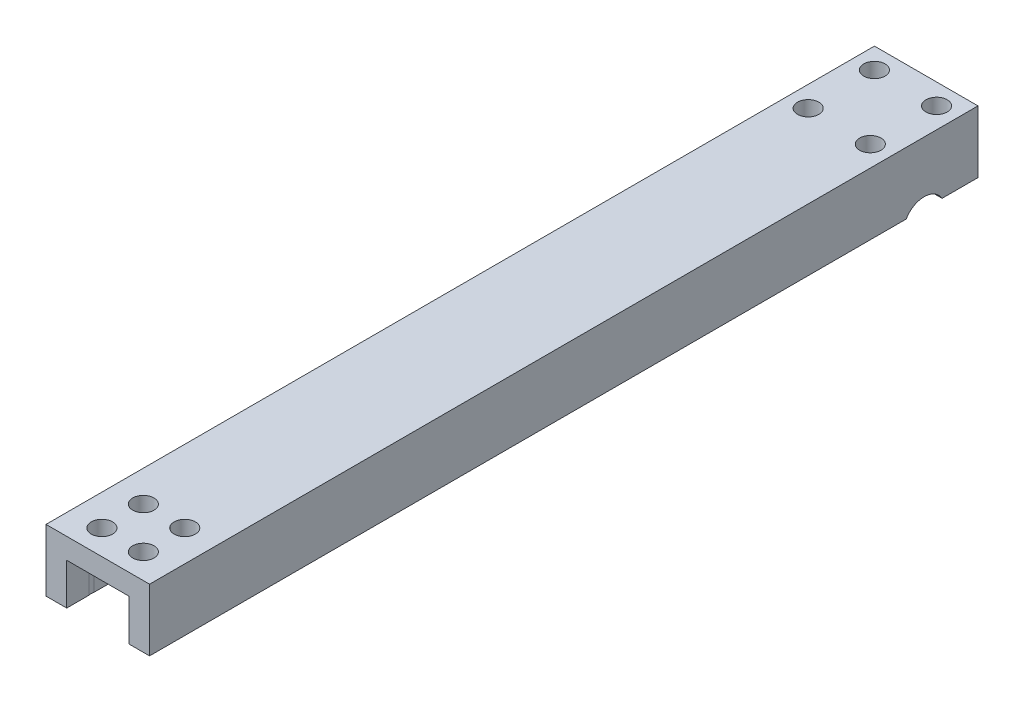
ISO-10303-21;
HEADER;
FILE_DESCRIPTION(('STEP AP214'),'2;1');
FILE_NAME('part.step','',(''),(''),'','','');
FILE_SCHEMA(('AUTOMOTIVE_DESIGN { 1 0 10303 214 1 1 1 1 }'));
ENDSEC;
DATA;
#1=APPLICATION_CONTEXT('core data for automotive mechanical design processes');
#2=APPLICATION_PROTOCOL_DEFINITION('international standard','automotive_design',2000,#1);
#3=PRODUCT_CONTEXT('',#1,'mechanical');
#4=PRODUCT('Part','Part','',(#3));
#5=PRODUCT_RELATED_PRODUCT_CATEGORY('part','',(#4));
#6=PRODUCT_DEFINITION_FORMATION('','',#4);
#7=PRODUCT_DEFINITION_CONTEXT('part definition',#1,'design');
#8=PRODUCT_DEFINITION('design','',#6,#7);
#9=PRODUCT_DEFINITION_SHAPE('','',#8);
#10=(LENGTH_UNIT() NAMED_UNIT(*) SI_UNIT(.MILLI.,.METRE.));
#11=(NAMED_UNIT(*) PLANE_ANGLE_UNIT() SI_UNIT($,.RADIAN.));
#12=(NAMED_UNIT(*) SI_UNIT($,.STERADIAN.) SOLID_ANGLE_UNIT());
#13=UNCERTAINTY_MEASURE_WITH_UNIT(LENGTH_MEASURE(1.E-05),#10,'distance_accuracy_value','');
#14=(GEOMETRIC_REPRESENTATION_CONTEXT(3) GLOBAL_UNCERTAINTY_ASSIGNED_CONTEXT((#13)) GLOBAL_UNIT_ASSIGNED_CONTEXT((#10,
#11,#12)) REPRESENTATION_CONTEXT('',''));
#15=CARTESIAN_POINT('',(0.,0.,0.));
#16=DIRECTION('',(0.,0.,1.));
#17=DIRECTION('',(1.,0.,0.));
#18=AXIS2_PLACEMENT_3D('',#15,#16,#17);
#19=CARTESIAN_POINT('',(-7.9375,0.,63.5));
#20=DIRECTION('',(0.,1.,0.));
#21=DIRECTION('',(0.,0.,1.));
#22=AXIS2_PLACEMENT_3D('',#19,#20,#21);
#23=PLANE('',#22);
#24=CARTESIAN_POINT('',(-4.7625,0.,-50.165));
#25=DIRECTION('',(0.,1.,0.));
#26=DIRECTION('',(0.,0.,1.));
#27=AXIS2_PLACEMENT_3D('',#24,#25,#26);
#28=CIRCLE('',#27,1.63195);
#29=CARTESIAN_POINT('',(-4.7625,0.,-48.53305));
#30=VERTEX_POINT('',#29);
#31=EDGE_CURVE('E286',#30,#30,#28,.T.);
#32=ORIENTED_EDGE('',*,*,#31,.T.);
#33=EDGE_LOOP('',(#32));
#34=FACE_BOUND('',#33,.T.);
#35=CARTESIAN_POINT('',(4.7625,0.,-50.165));
#36=DIRECTION('',(0.,1.,0.));
#37=DIRECTION('',(0.,0.,1.));
#38=AXIS2_PLACEMENT_3D('',#35,#36,#37);
#39=CIRCLE('',#38,1.63195);
#40=CARTESIAN_POINT('',(4.7625,0.,-48.53305));
#41=VERTEX_POINT('',#40);
#42=EDGE_CURVE('E266',#41,#41,#39,.T.);
#43=ORIENTED_EDGE('',*,*,#42,.T.);
#44=EDGE_LOOP('',(#43));
#45=FACE_BOUND('',#44,.T.);
#46=DIRECTION('',(0.,0.,-1.));
#47=VECTOR('',#46,1.);
#48=CARTESIAN_POINT('',(-7.9375,0.,63.5));
#49=LINE('',#48,#47);
#50=CARTESIAN_POINT('',(-7.9375,0.,63.5));
#51=VERTEX_POINT('',#50);
#52=CARTESIAN_POINT('',(-7.9375,0.,-52.4953693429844));
#53=VERTEX_POINT('',#52);
#54=EDGE_CURVE('E174',#51,#53,#49,.T.);
#55=ORIENTED_EDGE('',*,*,#54,.T.);
#56=DIRECTION('',(1.,0.,0.));
#57=VECTOR('',#56,1.);
#58=CARTESIAN_POINT('',(-7.9375,0.,-52.4953693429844));
#59=LINE('',#58,#57);
#60=CARTESIAN_POINT('',(7.9375,0.,-52.4953693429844));
#61=VERTEX_POINT('',#60);
#62=EDGE_CURVE('E155',#53,#61,#59,.T.);
#63=ORIENTED_EDGE('',*,*,#62,.T.);
#64=DIRECTION('',(0.,0.,-1.));
#65=VECTOR('',#64,1.);
#66=CARTESIAN_POINT('',(7.9375,0.,63.5));
#67=LINE('',#66,#65);
#68=CARTESIAN_POINT('',(7.9375,0.,63.5));
#69=VERTEX_POINT('',#68);
#70=EDGE_CURVE('E175',#69,#61,#67,.T.);
#71=ORIENTED_EDGE('',*,*,#70,.F.);
#72=DIRECTION('',(1.,0.,0.));
#73=VECTOR('',#72,1.);
#74=CARTESIAN_POINT('',(-7.9375,0.,63.5));
#75=LINE('',#74,#73);
#76=CARTESIAN_POINT('',(4.7625,0.,63.5));
#77=VERTEX_POINT('',#76);
#78=EDGE_CURVE('E234',#77,#69,#75,.T.);
#79=ORIENTED_EDGE('',*,*,#78,.F.);
#80=DIRECTION('',(0.,0.,-1.));
#81=VECTOR('',#80,1.);
#82=CARTESIAN_POINT('',(4.7625,0.,63.5));
#83=LINE('',#82,#81);
#84=CARTESIAN_POINT('',(4.7625,0.,60.0682916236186));
#85=VERTEX_POINT('',#84);
#86=EDGE_CURVE('E336',#77,#85,#83,.T.);
#87=ORIENTED_EDGE('',*,*,#86,.T.);
#88=CARTESIAN_POINT('',(3.175,0.,59.69));
#89=DIRECTION('',(0.,1.,0.));
#90=DIRECTION('',(0.,0.,1.));
#91=AXIS2_PLACEMENT_3D('',#88,#89,#90);
#92=CIRCLE('',#91,1.63195);
#93=CARTESIAN_POINT('',(4.7625,0.,59.3117083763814));
#94=VERTEX_POINT('',#93);
#95=EDGE_CURVE('E213',#85,#94,#92,.T.);
#96=ORIENTED_EDGE('',*,*,#95,.T.);
#97=CARTESIAN_POINT('',(4.7625,0.,53.7182916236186));
#98=VERTEX_POINT('',#97);
#99=EDGE_CURVE('E208',#94,#98,#83,.T.);
#100=ORIENTED_EDGE('',*,*,#99,.T.);
#101=CARTESIAN_POINT('',(3.175,0.,53.34));
#102=DIRECTION('',(0.,1.,0.));
#103=DIRECTION('',(0.,0.,1.));
#104=AXIS2_PLACEMENT_3D('',#101,#102,#103);
#105=CIRCLE('',#104,1.63195);
#106=CARTESIAN_POINT('',(4.7625,0.,52.9617083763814));
#107=VERTEX_POINT('',#106);
#108=EDGE_CURVE('E199',#98,#107,#105,.T.);
#109=ORIENTED_EDGE('',*,*,#108,.T.);
#110=CARTESIAN_POINT('',(4.7625,0.,-43.18));
#111=VERTEX_POINT('',#110);
#112=EDGE_CURVE('E206',#107,#111,#83,.T.);
#113=ORIENTED_EDGE('',*,*,#112,.T.);
#114=DIRECTION('',(-1.,0.,0.));
#115=VECTOR('',#114,1.);
#116=CARTESIAN_POINT('',(-7.9375,0.,-43.18));
#117=LINE('',#116,#115);
#118=CARTESIAN_POINT('',(-4.7625,0.,-43.18));
#119=VERTEX_POINT('',#118);
#120=EDGE_CURVE('E11',#111,#119,#117,.T.);
#121=ORIENTED_EDGE('',*,*,#120,.T.);
#122=DIRECTION('',(0.,0.,1.));
#123=VECTOR('',#122,1.);
#124=CARTESIAN_POINT('',(-4.7625,0.,63.5));
#125=LINE('',#124,#123);
#126=CARTESIAN_POINT('',(-4.76249999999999,0.,52.9617083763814));
#127=VERTEX_POINT('',#126);
#128=EDGE_CURVE('E320',#119,#127,#125,.T.);
#129=ORIENTED_EDGE('',*,*,#128,.T.);
#130=CARTESIAN_POINT('',(-3.175,0.,53.34));
#131=DIRECTION('',(0.,1.,0.));
#132=DIRECTION('',(0.,0.,1.));
#133=AXIS2_PLACEMENT_3D('',#130,#131,#132);
#134=CIRCLE('',#133,1.63195);
#135=CARTESIAN_POINT('',(-4.7625,0.,53.7182916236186));
#136=VERTEX_POINT('',#135);
#137=EDGE_CURVE('E216',#127,#136,#134,.T.);
#138=ORIENTED_EDGE('',*,*,#137,.T.);
#139=CARTESIAN_POINT('',(-4.76249999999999,0.,59.3117083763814));
#140=VERTEX_POINT('',#139);
#141=EDGE_CURVE('E311',#136,#140,#125,.T.);
#142=ORIENTED_EDGE('',*,*,#141,.T.);
#143=CARTESIAN_POINT('',(-3.175,0.,59.69));
#144=DIRECTION('',(0.,1.,0.));
#145=DIRECTION('',(0.,0.,1.));
#146=AXIS2_PLACEMENT_3D('',#143,#144,#145);
#147=CIRCLE('',#146,1.63195);
#148=CARTESIAN_POINT('',(-4.76249999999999,0.,60.0682916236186));
#149=VERTEX_POINT('',#148);
#150=EDGE_CURVE('E342',#140,#149,#147,.T.);
#151=ORIENTED_EDGE('',*,*,#150,.T.);
#152=CARTESIAN_POINT('',(-4.7625,0.,63.5));
#153=VERTEX_POINT('',#152);
#154=EDGE_CURVE('E321',#149,#153,#125,.T.);
#155=ORIENTED_EDGE('',*,*,#154,.T.);
#156=EDGE_CURVE('E235',#51,#153,#75,.T.);
#157=ORIENTED_EDGE('',*,*,#156,.F.);
#158=EDGE_LOOP('',(#55,#63,#71,#79,#87,#96,#100,#109,#113,#121,#129,#138,#142,#151,#155,#157));
#159=FACE_BOUND('',#158,.T.);
#160=ADVANCED_FACE('F29',(#34,#45,#159),#23,.F.);
#161=CARTESIAN_POINT('',(-7.9375,0.,63.5));
#162=DIRECTION('',(1.,0.,0.));
#163=DIRECTION('',(0.,0.,-1.));
#164=AXIS2_PLACEMENT_3D('',#161,#162,#163);
#165=PLANE('',#164);
#166=CARTESIAN_POINT('',(-7.9375,0.,-57.9946306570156));
#167=VERTEX_POINT('',#166);
#168=CARTESIAN_POINT('',(-7.9375,0.,-63.5));
#169=VERTEX_POINT('',#168);
#170=EDGE_CURVE('E166',#167,#169,#49,.T.);
#171=ORIENTED_EDGE('',*,*,#170,.F.);
#172=CARTESIAN_POINT('',(-7.9375,-1.5875,-55.245));
#173=DIRECTION('',(1.,0.,0.));
#174=DIRECTION('',(0.,0.,-1.));
#175=AXIS2_PLACEMENT_3D('',#172,#173,#174);
#176=CIRCLE('',#175,3.175);
#177=EDGE_CURVE('E152',#167,#53,#176,.T.);
#178=ORIENTED_EDGE('',*,*,#177,.T.);
#179=ORIENTED_EDGE('',*,*,#54,.F.);
#180=DIRECTION('',(0.,-1.,0.));
#181=VECTOR('',#180,1.);
#182=CARTESIAN_POINT('',(-7.9375,0.,63.5));
#183=LINE('',#182,#181);
#184=CARTESIAN_POINT('',(-7.9375,9.525,63.5));
#185=VERTEX_POINT('',#184);
#186=EDGE_CURVE('E231',#185,#51,#183,.T.);
#187=ORIENTED_EDGE('',*,*,#186,.F.);
#188=DIRECTION('',(0.,0.,-1.));
#189=VECTOR('',#188,1.);
#190=CARTESIAN_POINT('',(-7.9375,9.525,63.5));
#191=LINE('',#190,#189);
#192=CARTESIAN_POINT('',(-7.9375,9.525,-63.5));
#193=VERTEX_POINT('',#192);
#194=EDGE_CURVE('E242',#185,#193,#191,.T.);
#195=ORIENTED_EDGE('',*,*,#194,.T.);
#196=DIRECTION('',(0.,-1.,0.));
#197=VECTOR('',#196,1.);
#198=CARTESIAN_POINT('',(-7.9375,0.,-63.5));
#199=LINE('',#198,#197);
#200=EDGE_CURVE('E173',#193,#169,#199,.T.);
#201=ORIENTED_EDGE('',*,*,#200,.T.);
#202=EDGE_LOOP('',(#171,#178,#179,#187,#195,#201));
#203=FACE_BOUND('',#202,.T.);
#204=ADVANCED_FACE('F31',(#203),#165,.F.);
#205=CARTESIAN_POINT('',(4.76249999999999,0.,-60.325));
#206=DIRECTION('',(0.,1.,0.));
#207=DIRECTION('',(0.,0.,1.));
#208=AXIS2_PLACEMENT_3D('',#205,#206,#207);
#209=CIRCLE('',#208,1.63195);
#210=CARTESIAN_POINT('',(4.76249999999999,0.,-58.69305));
#211=VERTEX_POINT('',#210);
#212=EDGE_CURVE('E274',#211,#211,#209,.T.);
#213=ORIENTED_EDGE('',*,*,#212,.T.);
#214=EDGE_LOOP('',(#213));
#215=FACE_BOUND('',#214,.T.);
#216=CARTESIAN_POINT('',(-4.7625,0.,-60.325));
#217=DIRECTION('',(0.,1.,0.));
#218=DIRECTION('',(0.,0.,1.));
#219=AXIS2_PLACEMENT_3D('',#216,#217,#218);
#220=CIRCLE('',#219,1.63195);
#221=CARTESIAN_POINT('',(-4.7625,0.,-58.69305));
#222=VERTEX_POINT('',#221);
#223=EDGE_CURVE('E280',#222,#222,#220,.T.);
#224=ORIENTED_EDGE('',*,*,#223,.T.);
#225=EDGE_LOOP('',(#224));
#226=FACE_BOUND('',#225,.T.);
#227=CARTESIAN_POINT('',(7.9375,0.,-57.9946306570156));
#228=VERTEX_POINT('',#227);
#229=CARTESIAN_POINT('',(7.9375,0.,-63.5));
#230=VERTEX_POINT('',#229);
#231=EDGE_CURVE('E168',#228,#230,#67,.T.);
#232=ORIENTED_EDGE('',*,*,#231,.F.);
#233=DIRECTION('',(1.,0.,0.));
#234=VECTOR('',#233,1.);
#235=CARTESIAN_POINT('',(-7.9375,0.,-57.9946306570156));
#236=LINE('',#235,#234);
#237=EDGE_CURVE('E44',#228,#167,#236,.F.);
#238=ORIENTED_EDGE('',*,*,#237,.T.);
#239=ORIENTED_EDGE('',*,*,#170,.T.);
#240=DIRECTION('',(1.,0.,0.));
#241=VECTOR('',#240,1.);
#242=CARTESIAN_POINT('',(-7.9375,0.,-63.5));
#243=LINE('',#242,#241);
#244=EDGE_CURVE('E225',#169,#230,#243,.T.);
#245=ORIENTED_EDGE('',*,*,#244,.T.);
#246=EDGE_LOOP('',(#232,#238,#239,#245));
#247=FACE_BOUND('',#246,.T.);
#248=ADVANCED_FACE('F164',(#215,#226,#247),#23,.F.);
#249=CARTESIAN_POINT('',(7.9375,0.,63.5));
#250=DIRECTION('',(-1.,0.,0.));
#251=DIRECTION('',(0.,0.,1.));
#252=AXIS2_PLACEMENT_3D('',#249,#250,#251);
#253=PLANE('',#252);
#254=ORIENTED_EDGE('',*,*,#70,.T.);
#255=CARTESIAN_POINT('',(7.9375,-1.5875,-55.245));
#256=DIRECTION('',(1.,0.,0.));
#257=DIRECTION('',(0.,0.,-1.));
#258=AXIS2_PLACEMENT_3D('',#255,#256,#257);
#259=CIRCLE('',#258,3.175);
#260=EDGE_CURVE('E160',#228,#61,#259,.T.);
#261=ORIENTED_EDGE('',*,*,#260,.F.);
#262=ORIENTED_EDGE('',*,*,#231,.T.);
#263=DIRECTION('',(0.,1.,0.));
#264=VECTOR('',#263,1.);
#265=CARTESIAN_POINT('',(7.9375,0.,-63.5));
#266=LINE('',#265,#264);
#267=CARTESIAN_POINT('',(7.9375,9.525,-63.5));
#268=VERTEX_POINT('',#267);
#269=EDGE_CURVE('E227',#230,#268,#266,.T.);
#270=ORIENTED_EDGE('',*,*,#269,.T.);
#271=DIRECTION('',(0.,0.,-1.));
#272=VECTOR('',#271,1.);
#273=CARTESIAN_POINT('',(7.9375,9.525,63.5));
#274=LINE('',#273,#272);
#275=CARTESIAN_POINT('',(7.9375,9.525,63.5));
#276=VERTEX_POINT('',#275);
#277=EDGE_CURVE('E243',#276,#268,#274,.T.);
#278=ORIENTED_EDGE('',*,*,#277,.F.);
#279=DIRECTION('',(0.,1.,0.));
#280=VECTOR('',#279,1.);
#281=CARTESIAN_POINT('',(7.9375,0.,63.5));
#282=LINE('',#281,#280);
#283=EDGE_CURVE('E238',#69,#276,#282,.T.);
#284=ORIENTED_EDGE('',*,*,#283,.F.);
#285=EDGE_LOOP('',(#254,#261,#262,#270,#278,#284));
#286=FACE_BOUND('',#285,.T.);
#287=ADVANCED_FACE('F250',(#286),#253,.F.);
#288=CARTESIAN_POINT('',(-7.9375,9.525,63.5));
#289=DIRECTION('',(0.,-1.,0.));
#290=DIRECTION('',(0.,0.,-1.));
#291=AXIS2_PLACEMENT_3D('',#288,#289,#290);
#292=PLANE('',#291);
#293=CARTESIAN_POINT('',(4.7625,9.525,-50.165));
#294=DIRECTION('',(0.,1.,0.));
#295=DIRECTION('',(0.,0.,1.));
#296=AXIS2_PLACEMENT_3D('',#293,#294,#295);
#297=CIRCLE('',#296,1.63194999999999);
#298=CARTESIAN_POINT('',(4.7625,9.525,-48.53305));
#299=VERTEX_POINT('',#298);
#300=EDGE_CURVE('E269',#299,#299,#297,.T.);
#301=ORIENTED_EDGE('',*,*,#300,.F.);
#302=EDGE_LOOP('',(#301));
#303=FACE_BOUND('',#302,.T.);
#304=CARTESIAN_POINT('',(4.76249999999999,9.525,-60.325));
#305=DIRECTION('',(0.,1.,0.));
#306=DIRECTION('',(0.,0.,1.));
#307=AXIS2_PLACEMENT_3D('',#304,#305,#306);
#308=CIRCLE('',#307,1.63194999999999);
#309=CARTESIAN_POINT('',(4.76249999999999,9.525,-58.69305));
#310=VERTEX_POINT('',#309);
#311=EDGE_CURVE('E277',#310,#310,#308,.T.);
#312=ORIENTED_EDGE('',*,*,#311,.F.);
#313=EDGE_LOOP('',(#312));
#314=FACE_BOUND('',#313,.T.);
#315=CARTESIAN_POINT('',(-4.7625,9.525,-60.325));
#316=DIRECTION('',(0.,1.,0.));
#317=DIRECTION('',(0.,0.,1.));
#318=AXIS2_PLACEMENT_3D('',#315,#316,#317);
#319=CIRCLE('',#318,1.63194999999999);
#320=CARTESIAN_POINT('',(-4.7625,9.525,-58.69305));
#321=VERTEX_POINT('',#320);
#322=EDGE_CURVE('E283',#321,#321,#319,.T.);
#323=ORIENTED_EDGE('',*,*,#322,.F.);
#324=EDGE_LOOP('',(#323));
#325=FACE_BOUND('',#324,.T.);
#326=CARTESIAN_POINT('',(-4.7625,9.525,-50.165));
#327=DIRECTION('',(0.,1.,0.));
#328=DIRECTION('',(0.,0.,1.));
#329=AXIS2_PLACEMENT_3D('',#326,#327,#328);
#330=CIRCLE('',#329,1.63194999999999);
#331=CARTESIAN_POINT('',(-4.7625,9.525,-48.53305));
#332=VERTEX_POINT('',#331);
#333=EDGE_CURVE('E289',#332,#332,#330,.T.);
#334=ORIENTED_EDGE('',*,*,#333,.F.);
#335=EDGE_LOOP('',(#334));
#336=FACE_BOUND('',#335,.T.);
#337=CARTESIAN_POINT('',(-3.175,9.525,59.69));
#338=DIRECTION('',(0.,1.,0.));
#339=DIRECTION('',(0.,0.,1.));
#340=AXIS2_PLACEMENT_3D('',#337,#338,#339);
#341=CIRCLE('',#340,1.63194999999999);
#342=CARTESIAN_POINT('',(-3.175,9.525,61.32195));
#343=VERTEX_POINT('',#342);
#344=EDGE_CURVE('E345',#343,#343,#341,.T.);
#345=ORIENTED_EDGE('',*,*,#344,.F.);
#346=EDGE_LOOP('',(#345));
#347=FACE_BOUND('',#346,.T.);
#348=CARTESIAN_POINT('',(-3.175,9.525,53.34));
#349=DIRECTION('',(0.,1.,0.));
#350=DIRECTION('',(0.,0.,1.));
#351=AXIS2_PLACEMENT_3D('',#348,#349,#350);
#352=CIRCLE('',#351,1.63194999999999);
#353=CARTESIAN_POINT('',(-3.175,9.525,54.97195));
#354=VERTEX_POINT('',#353);
#355=EDGE_CURVE('E210',#354,#354,#352,.T.);
#356=ORIENTED_EDGE('',*,*,#355,.F.);
#357=EDGE_LOOP('',(#356));
#358=FACE_BOUND('',#357,.T.);
#359=CARTESIAN_POINT('',(3.175,9.525,53.34));
#360=DIRECTION('',(0.,1.,0.));
#361=DIRECTION('',(0.,0.,1.));
#362=AXIS2_PLACEMENT_3D('',#359,#360,#361);
#363=CIRCLE('',#362,1.63194999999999);
#364=CARTESIAN_POINT('',(3.175,9.525,54.97195));
#365=VERTEX_POINT('',#364);
#366=EDGE_CURVE('E209',#365,#365,#363,.T.);
#367=ORIENTED_EDGE('',*,*,#366,.F.);
#368=EDGE_LOOP('',(#367));
#369=FACE_BOUND('',#368,.T.);
#370=CARTESIAN_POINT('',(3.175,9.525,59.69));
#371=DIRECTION('',(0.,1.,0.));
#372=DIRECTION('',(0.,0.,1.));
#373=AXIS2_PLACEMENT_3D('',#370,#371,#372);
#374=CIRCLE('',#373,1.63194999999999);
#375=CARTESIAN_POINT('',(3.175,9.525,61.32195));
#376=VERTEX_POINT('',#375);
#377=EDGE_CURVE('E221',#376,#376,#374,.T.);
#378=ORIENTED_EDGE('',*,*,#377,.F.);
#379=EDGE_LOOP('',(#378));
#380=FACE_BOUND('',#379,.T.);
#381=DIRECTION('',(-1.,0.,0.));
#382=VECTOR('',#381,1.);
#383=CARTESIAN_POINT('',(-7.9375,9.525,-63.5));
#384=LINE('',#383,#382);
#385=EDGE_CURVE('E229',#268,#193,#384,.T.);
#386=ORIENTED_EDGE('',*,*,#385,.T.);
#387=ORIENTED_EDGE('',*,*,#194,.F.);
#388=DIRECTION('',(-1.,0.,0.));
#389=VECTOR('',#388,1.);
#390=CARTESIAN_POINT('',(-7.9375,9.525,63.5));
#391=LINE('',#390,#389);
#392=EDGE_CURVE('E240',#276,#185,#391,.T.);
#393=ORIENTED_EDGE('',*,*,#392,.F.);
#394=ORIENTED_EDGE('',*,*,#277,.T.);
#395=EDGE_LOOP('',(#386,#387,#393,#394));
#396=FACE_BOUND('',#395,.T.);
#397=ADVANCED_FACE('F255',(#303,#314,#325,#336,#347,#358,#369,#380,#396),#292,.F.);
#398=CARTESIAN_POINT('',(-7.9375,9.525,63.5));
#399=DIRECTION('',(0.,0.,-1.));
#400=DIRECTION('',(-1.,0.,0.));
#401=AXIS2_PLACEMENT_3D('',#398,#399,#400);
#402=PLANE('',#401);
#403=DIRECTION('',(1.,0.,0.));
#404=VECTOR('',#403,1.);
#405=CARTESIAN_POINT('',(4.7625,6.35,63.5));
#406=LINE('',#405,#404);
#407=CARTESIAN_POINT('',(-4.7625,6.35,63.5));
#408=VERTEX_POINT('',#407);
#409=CARTESIAN_POINT('',(4.7625,6.35,63.5));
#410=VERTEX_POINT('',#409);
#411=EDGE_CURVE('E305',#408,#410,#406,.T.);
#412=ORIENTED_EDGE('',*,*,#411,.T.);
#413=DIRECTION('',(0.,-1.,0.));
#414=VECTOR('',#413,1.);
#415=CARTESIAN_POINT('',(4.7625,6.35,63.5));
#416=LINE('',#415,#414);
#417=EDGE_CURVE('E301',#410,#77,#416,.T.);
#418=ORIENTED_EDGE('',*,*,#417,.T.);
#419=ORIENTED_EDGE('',*,*,#78,.T.);
#420=ORIENTED_EDGE('',*,*,#283,.T.);
#421=ORIENTED_EDGE('',*,*,#392,.T.);
#422=ORIENTED_EDGE('',*,*,#186,.T.);
#423=ORIENTED_EDGE('',*,*,#156,.T.);
#424=DIRECTION('',(0.,1.,0.));
#425=VECTOR('',#424,1.);
#426=CARTESIAN_POINT('',(-4.7625,6.35,63.5));
#427=LINE('',#426,#425);
#428=EDGE_CURVE('E303',#153,#408,#427,.T.);
#429=ORIENTED_EDGE('',*,*,#428,.T.);
#430=EDGE_LOOP('',(#412,#418,#419,#420,#421,#422,#423,#429));
#431=FACE_BOUND('',#430,.T.);
#432=ADVANCED_FACE('F259',(#431),#402,.F.);
#433=CARTESIAN_POINT('',(-7.9375,9.525,-63.5));
#434=DIRECTION('',(0.,0.,-1.));
#435=DIRECTION('',(-1.,0.,0.));
#436=AXIS2_PLACEMENT_3D('',#433,#434,#435);
#437=PLANE('',#436);
#438=ORIENTED_EDGE('',*,*,#200,.F.);
#439=ORIENTED_EDGE('',*,*,#385,.F.);
#440=ORIENTED_EDGE('',*,*,#269,.F.);
#441=ORIENTED_EDGE('',*,*,#244,.F.);
#442=EDGE_LOOP('',(#438,#439,#440,#441));
#443=FACE_BOUND('',#442,.T.);
#444=ADVANCED_FACE('F253',(#443),#437,.T.);
#445=CARTESIAN_POINT('',(3.175,9.525,59.69));
#446=DIRECTION('',(0.,1.,0.));
#447=DIRECTION('',(0.,0.,1.));
#448=AXIS2_PLACEMENT_3D('',#445,#446,#447);
#449=CYLINDRICAL_SURFACE('',#448,1.63194999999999);
#450=CARTESIAN_POINT('',(3.175,6.35,59.69));
#451=DIRECTION('',(0.,1.,0.));
#452=DIRECTION('',(-1.,0.,0.));
#453=AXIS2_PLACEMENT_3D('',#450,#451,#452);
#454=CIRCLE('',#453,1.63194999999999);
#455=CARTESIAN_POINT('',(4.7625,6.35,60.0682916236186));
#456=VERTEX_POINT('',#455);
#457=CARTESIAN_POINT('',(4.7625,6.35,59.3117083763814));
#458=VERTEX_POINT('',#457);
#459=EDGE_CURVE('E331',#456,#458,#454,.F.);
#460=ORIENTED_EDGE('',*,*,#459,.T.);
#461=DIRECTION('',(0.,1.,0.));
#462=VECTOR('',#461,1.);
#463=CARTESIAN_POINT('',(4.7625,9.525,59.3117083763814));
#464=LINE('',#463,#462);
#465=EDGE_CURVE('E335',#458,#94,#464,.F.);
#466=ORIENTED_EDGE('',*,*,#465,.T.);
#467=ORIENTED_EDGE('',*,*,#95,.F.);
#468=DIRECTION('',(0.,1.,0.));
#469=VECTOR('',#468,1.);
#470=CARTESIAN_POINT('',(4.7625,9.525,60.0682916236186));
#471=LINE('',#470,#469);
#472=EDGE_CURVE('E339',#85,#456,#471,.T.);
#473=ORIENTED_EDGE('',*,*,#472,.T.);
#474=EDGE_LOOP('',(#460,#466,#467,#473));
#475=FACE_BOUND('',#474,.T.);
#476=ORIENTED_EDGE('',*,*,#377,.T.);
#477=EDGE_LOOP('',(#476));
#478=FACE_BOUND('',#477,.T.);
#479=ADVANCED_FACE('F371',(#475,#478),#449,.F.);
#480=CARTESIAN_POINT('',(3.175,9.525,53.34));
#481=DIRECTION('',(0.,1.,0.));
#482=DIRECTION('',(0.,0.,1.));
#483=AXIS2_PLACEMENT_3D('',#480,#481,#482);
#484=CYLINDRICAL_SURFACE('',#483,1.63194999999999);
#485=CARTESIAN_POINT('',(3.175,6.35,53.34));
#486=DIRECTION('',(0.,1.,0.));
#487=DIRECTION('',(-1.,0.,0.));
#488=AXIS2_PLACEMENT_3D('',#485,#486,#487);
#489=CIRCLE('',#488,1.63194999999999);
#490=CARTESIAN_POINT('',(4.7625,6.35,53.7182916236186));
#491=VERTEX_POINT('',#490);
#492=CARTESIAN_POINT('',(4.7625,6.35,52.9617083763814));
#493=VERTEX_POINT('',#492);
#494=EDGE_CURVE('E200',#491,#493,#489,.F.);
#495=ORIENTED_EDGE('',*,*,#494,.T.);
#496=DIRECTION('',(0.,1.,0.));
#497=VECTOR('',#496,1.);
#498=CARTESIAN_POINT('',(4.7625,9.525,52.9617083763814));
#499=LINE('',#498,#497);
#500=EDGE_CURVE('E37',#493,#107,#499,.F.);
#501=ORIENTED_EDGE('',*,*,#500,.T.);
#502=ORIENTED_EDGE('',*,*,#108,.F.);
#503=DIRECTION('',(0.,1.,0.));
#504=VECTOR('',#503,1.);
#505=CARTESIAN_POINT('',(4.7625,9.525,53.7182916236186));
#506=LINE('',#505,#504);
#507=EDGE_CURVE('E190',#98,#491,#506,.T.);
#508=ORIENTED_EDGE('',*,*,#507,.T.);
#509=EDGE_LOOP('',(#495,#501,#502,#508));
#510=FACE_BOUND('',#509,.T.);
#511=ORIENTED_EDGE('',*,*,#366,.T.);
#512=EDGE_LOOP('',(#511));
#513=FACE_BOUND('',#512,.T.);
#514=ADVANCED_FACE('F197',(#510,#513),#484,.F.);
#515=CARTESIAN_POINT('',(-3.175,9.525,53.34));
#516=DIRECTION('',(0.,1.,0.));
#517=DIRECTION('',(0.,0.,1.));
#518=AXIS2_PLACEMENT_3D('',#515,#516,#517);
#519=CYLINDRICAL_SURFACE('',#518,1.63194999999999);
#520=CARTESIAN_POINT('',(-3.175,6.35,53.34));
#521=DIRECTION('',(0.,1.,0.));
#522=DIRECTION('',(-1.,0.,0.));
#523=AXIS2_PLACEMENT_3D('',#520,#521,#522);
#524=CIRCLE('',#523,1.63194999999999);
#525=CARTESIAN_POINT('',(-4.7625,6.35,52.9617083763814));
#526=VERTEX_POINT('',#525);
#527=CARTESIAN_POINT('',(-4.7625,6.35,53.7182916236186));
#528=VERTEX_POINT('',#527);
#529=EDGE_CURVE('E327',#526,#528,#524,.F.);
#530=ORIENTED_EDGE('',*,*,#529,.T.);
#531=DIRECTION('',(0.,1.,0.));
#532=VECTOR('',#531,1.);
#533=CARTESIAN_POINT('',(-4.76249999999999,9.525,53.7182916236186));
#534=LINE('',#533,#532);
#535=EDGE_CURVE('E319',#528,#136,#534,.F.);
#536=ORIENTED_EDGE('',*,*,#535,.T.);
#537=ORIENTED_EDGE('',*,*,#137,.F.);
#538=DIRECTION('',(0.,1.,0.));
#539=VECTOR('',#538,1.);
#540=CARTESIAN_POINT('',(-4.76249999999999,9.525,52.9617083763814));
#541=LINE('',#540,#539);
#542=EDGE_CURVE('E324',#127,#526,#541,.T.);
#543=ORIENTED_EDGE('',*,*,#542,.T.);
#544=EDGE_LOOP('',(#530,#536,#537,#543));
#545=FACE_BOUND('',#544,.T.);
#546=ORIENTED_EDGE('',*,*,#355,.T.);
#547=EDGE_LOOP('',(#546));
#548=FACE_BOUND('',#547,.T.);
#549=ADVANCED_FACE('F352',(#545,#548),#519,.F.);
#550=CARTESIAN_POINT('',(-3.175,9.525,59.69));
#551=DIRECTION('',(0.,1.,0.));
#552=DIRECTION('',(0.,0.,1.));
#553=AXIS2_PLACEMENT_3D('',#550,#551,#552);
#554=CYLINDRICAL_SURFACE('',#553,1.63194999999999);
#555=CARTESIAN_POINT('',(-3.175,6.35,59.69));
#556=DIRECTION('',(0.,1.,0.));
#557=DIRECTION('',(-1.,0.,0.));
#558=AXIS2_PLACEMENT_3D('',#555,#556,#557);
#559=CIRCLE('',#558,1.63194999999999);
#560=CARTESIAN_POINT('',(-4.76249999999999,6.35,59.3117083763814));
#561=VERTEX_POINT('',#560);
#562=CARTESIAN_POINT('',(-4.7625,6.35,60.0682916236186));
#563=VERTEX_POINT('',#562);
#564=EDGE_CURVE('E184',#561,#563,#559,.F.);
#565=ORIENTED_EDGE('',*,*,#564,.T.);
#566=DIRECTION('',(0.,1.,0.));
#567=VECTOR('',#566,1.);
#568=CARTESIAN_POINT('',(-4.76249999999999,9.525,60.0682916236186));
#569=LINE('',#568,#567);
#570=EDGE_CURVE('E187',#563,#149,#569,.F.);
#571=ORIENTED_EDGE('',*,*,#570,.T.);
#572=ORIENTED_EDGE('',*,*,#150,.F.);
#573=DIRECTION('',(0.,1.,0.));
#574=VECTOR('',#573,1.);
#575=CARTESIAN_POINT('',(-4.76249999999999,9.525,59.3117083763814));
#576=LINE('',#575,#574);
#577=EDGE_CURVE('E177',#140,#561,#576,.T.);
#578=ORIENTED_EDGE('',*,*,#577,.T.);
#579=EDGE_LOOP('',(#565,#571,#572,#578));
#580=FACE_BOUND('',#579,.T.);
#581=ORIENTED_EDGE('',*,*,#344,.T.);
#582=EDGE_LOOP('',(#581));
#583=FACE_BOUND('',#582,.T.);
#584=ADVANCED_FACE('F382',(#580,#583),#554,.F.);
#585=CARTESIAN_POINT('',(4.7625,-10.3749701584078,-43.18));
#586=DIRECTION('',(0.,0.,-1.));
#587=DIRECTION('',(-1.,0.,0.));
#588=AXIS2_PLACEMENT_3D('',#585,#586,#587);
#589=PLANE('',#588);
#590=DIRECTION('',(0.,-1.,0.));
#591=VECTOR('',#590,1.);
#592=CARTESIAN_POINT('',(4.7625,6.35,-43.18));
#593=LINE('',#592,#591);
#594=CARTESIAN_POINT('',(4.7625,6.35,-43.18));
#595=VERTEX_POINT('',#594);
#596=EDGE_CURVE('E292',#595,#111,#593,.T.);
#597=ORIENTED_EDGE('',*,*,#596,.F.);
#598=DIRECTION('',(1.,0.,0.));
#599=VECTOR('',#598,1.);
#600=CARTESIAN_POINT('',(4.7625,6.35,-43.18));
#601=LINE('',#600,#599);
#602=CARTESIAN_POINT('',(-4.7625,6.35,-43.18));
#603=VERTEX_POINT('',#602);
#604=EDGE_CURVE('E298',#603,#595,#601,.T.);
#605=ORIENTED_EDGE('',*,*,#604,.F.);
#606=DIRECTION('',(0.,1.,0.));
#607=VECTOR('',#606,1.);
#608=CARTESIAN_POINT('',(-4.7625,6.35,-43.18));
#609=LINE('',#608,#607);
#610=EDGE_CURVE('E295',#119,#603,#609,.T.);
#611=ORIENTED_EDGE('',*,*,#610,.F.);
#612=ORIENTED_EDGE('',*,*,#120,.F.);
#613=EDGE_LOOP('',(#597,#605,#611,#612));
#614=FACE_BOUND('',#613,.T.);
#615=ADVANCED_FACE('F364',(#614),#589,.F.);
#616=CARTESIAN_POINT('',(4.7625,6.35,63.5));
#617=DIRECTION('',(1.,0.,0.));
#618=DIRECTION('',(0.,1.,0.));
#619=AXIS2_PLACEMENT_3D('',#616,#617,#618);
#620=PLANE('',#619);
#621=ORIENTED_EDGE('',*,*,#417,.F.);
#622=DIRECTION('',(0.,0.,-1.));
#623=VECTOR('',#622,1.);
#624=CARTESIAN_POINT('',(4.7625,6.35,63.5));
#625=LINE('',#624,#623);
#626=EDGE_CURVE('E308',#410,#456,#625,.T.);
#627=ORIENTED_EDGE('',*,*,#626,.T.);
#628=ORIENTED_EDGE('',*,*,#472,.F.);
#629=ORIENTED_EDGE('',*,*,#86,.F.);
#630=EDGE_LOOP('',(#621,#627,#628,#629));
#631=FACE_BOUND('',#630,.T.);
#632=ADVANCED_FACE('F376',(#631),#620,.F.);
#633=ORIENTED_EDGE('',*,*,#500,.F.);
#634=EDGE_CURVE('E313',#493,#595,#625,.T.);
#635=ORIENTED_EDGE('',*,*,#634,.T.);
#636=ORIENTED_EDGE('',*,*,#596,.T.);
#637=ORIENTED_EDGE('',*,*,#112,.F.);
#638=EDGE_LOOP('',(#633,#635,#636,#637));
#639=FACE_BOUND('',#638,.T.);
#640=ADVANCED_FACE('F365',(#639),#620,.F.);
#641=EDGE_CURVE('E312',#458,#491,#625,.T.);
#642=ORIENTED_EDGE('',*,*,#641,.T.);
#643=ORIENTED_EDGE('',*,*,#507,.F.);
#644=ORIENTED_EDGE('',*,*,#99,.F.);
#645=ORIENTED_EDGE('',*,*,#465,.F.);
#646=EDGE_LOOP('',(#642,#643,#644,#645));
#647=FACE_BOUND('',#646,.T.);
#648=ADVANCED_FACE('F369',(#647),#620,.F.);
#649=CARTESIAN_POINT('',(4.7625,6.35,63.5));
#650=DIRECTION('',(0.,1.,0.));
#651=DIRECTION('',(-1.,0.,0.));
#652=AXIS2_PLACEMENT_3D('',#649,#650,#651);
#653=PLANE('',#652);
#654=ORIENTED_EDGE('',*,*,#626,.F.);
#655=ORIENTED_EDGE('',*,*,#411,.F.);
#656=DIRECTION('',(0.,0.,-1.));
#657=VECTOR('',#656,1.);
#658=CARTESIAN_POINT('',(-4.7625,6.35,63.5));
#659=LINE('',#658,#657);
#660=EDGE_CURVE('E314',#408,#563,#659,.T.);
#661=ORIENTED_EDGE('',*,*,#660,.T.);
#662=ORIENTED_EDGE('',*,*,#564,.F.);
#663=EDGE_CURVE('E52',#561,#528,#659,.T.);
#664=ORIENTED_EDGE('',*,*,#663,.T.);
#665=ORIENTED_EDGE('',*,*,#529,.F.);
#666=EDGE_CURVE('E307',#526,#603,#659,.T.);
#667=ORIENTED_EDGE('',*,*,#666,.T.);
#668=ORIENTED_EDGE('',*,*,#604,.T.);
#669=ORIENTED_EDGE('',*,*,#634,.F.);
#670=ORIENTED_EDGE('',*,*,#494,.F.);
#671=ORIENTED_EDGE('',*,*,#641,.F.);
#672=ORIENTED_EDGE('',*,*,#459,.F.);
#673=EDGE_LOOP('',(#654,#655,#661,#662,#664,#665,#667,#668,#669,#670,#671,#672));
#674=FACE_BOUND('',#673,.T.);
#675=ADVANCED_FACE('F356',(#674),#653,.F.);
#676=CARTESIAN_POINT('',(-4.7625,6.35,63.5));
#677=DIRECTION('',(-1.,0.,0.));
#678=DIRECTION('',(0.,-1.,0.));
#679=AXIS2_PLACEMENT_3D('',#676,#677,#678);
#680=PLANE('',#679);
#681=ORIENTED_EDGE('',*,*,#610,.T.);
#682=ORIENTED_EDGE('',*,*,#666,.F.);
#683=ORIENTED_EDGE('',*,*,#542,.F.);
#684=ORIENTED_EDGE('',*,*,#128,.F.);
#685=EDGE_LOOP('',(#681,#682,#683,#684));
#686=FACE_BOUND('',#685,.T.);
#687=ADVANCED_FACE('F361',(#686),#680,.F.);
#688=ORIENTED_EDGE('',*,*,#570,.F.);
#689=ORIENTED_EDGE('',*,*,#660,.F.);
#690=ORIENTED_EDGE('',*,*,#428,.F.);
#691=ORIENTED_EDGE('',*,*,#154,.F.);
#692=EDGE_LOOP('',(#688,#689,#690,#691));
#693=FACE_BOUND('',#692,.T.);
#694=ADVANCED_FACE('F380',(#693),#680,.F.);
#695=ORIENTED_EDGE('',*,*,#663,.F.);
#696=ORIENTED_EDGE('',*,*,#577,.F.);
#697=ORIENTED_EDGE('',*,*,#141,.F.);
#698=ORIENTED_EDGE('',*,*,#535,.F.);
#699=EDGE_LOOP('',(#695,#696,#697,#698));
#700=FACE_BOUND('',#699,.T.);
#701=ADVANCED_FACE('F354',(#700),#680,.F.);
#702=CARTESIAN_POINT('',(-4.7625,9.525,-50.165));
#703=DIRECTION('',(0.,1.,0.));
#704=DIRECTION('',(0.,0.,1.));
#705=AXIS2_PLACEMENT_3D('',#702,#703,#704);
#706=CYLINDRICAL_SURFACE('',#705,1.63194999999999);
#707=ORIENTED_EDGE('',*,*,#31,.F.);
#708=EDGE_LOOP('',(#707));
#709=FACE_BOUND('',#708,.T.);
#710=ORIENTED_EDGE('',*,*,#333,.T.);
#711=EDGE_LOOP('',(#710));
#712=FACE_BOUND('',#711,.T.);
#713=ADVANCED_FACE('F427',(#709,#712),#706,.F.);
#714=CARTESIAN_POINT('',(-4.7625,9.525,-60.325));
#715=DIRECTION('',(0.,1.,0.));
#716=DIRECTION('',(0.,0.,1.));
#717=AXIS2_PLACEMENT_3D('',#714,#715,#716);
#718=CYLINDRICAL_SURFACE('',#717,1.63194999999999);
#719=ORIENTED_EDGE('',*,*,#223,.F.);
#720=EDGE_LOOP('',(#719));
#721=FACE_BOUND('',#720,.T.);
#722=ORIENTED_EDGE('',*,*,#322,.T.);
#723=EDGE_LOOP('',(#722));
#724=FACE_BOUND('',#723,.T.);
#725=ADVANCED_FACE('F423',(#721,#724),#718,.F.);
#726=CARTESIAN_POINT('',(4.76249999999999,9.525,-60.325));
#727=DIRECTION('',(0.,1.,0.));
#728=DIRECTION('',(0.,0.,1.));
#729=AXIS2_PLACEMENT_3D('',#726,#727,#728);
#730=CYLINDRICAL_SURFACE('',#729,1.63194999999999);
#731=ORIENTED_EDGE('',*,*,#212,.F.);
#732=EDGE_LOOP('',(#731));
#733=FACE_BOUND('',#732,.T.);
#734=ORIENTED_EDGE('',*,*,#311,.T.);
#735=EDGE_LOOP('',(#734));
#736=FACE_BOUND('',#735,.T.);
#737=ADVANCED_FACE('F426',(#733,#736),#730,.F.);
#738=CARTESIAN_POINT('',(4.7625,9.525,-50.165));
#739=DIRECTION('',(0.,1.,0.));
#740=DIRECTION('',(0.,0.,1.));
#741=AXIS2_PLACEMENT_3D('',#738,#739,#740);
#742=CYLINDRICAL_SURFACE('',#741,1.63194999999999);
#743=ORIENTED_EDGE('',*,*,#42,.F.);
#744=EDGE_LOOP('',(#743));
#745=FACE_BOUND('',#744,.T.);
#746=ORIENTED_EDGE('',*,*,#300,.T.);
#747=EDGE_LOOP('',(#746));
#748=FACE_BOUND('',#747,.T.);
#749=ADVANCED_FACE('F527',(#745,#748),#742,.F.);
#750=CARTESIAN_POINT('',(-7.9375,-1.5875,-55.245));
#751=DIRECTION('',(1.,0.,0.));
#752=DIRECTION('',(0.,0.,-1.));
#753=AXIS2_PLACEMENT_3D('',#750,#751,#752);
#754=CYLINDRICAL_SURFACE('',#753,3.175);
#755=ORIENTED_EDGE('',*,*,#177,.F.);
#756=ORIENTED_EDGE('',*,*,#237,.F.);
#757=ORIENTED_EDGE('',*,*,#260,.T.);
#758=ORIENTED_EDGE('',*,*,#62,.F.);
#759=EDGE_LOOP('',(#755,#756,#757,#758));
#760=FACE_BOUND('',#759,.T.);
#761=ADVANCED_FACE('F153',(#760),#754,.F.);
#762=CLOSED_SHELL('',(#160,#204,#248,#287,#397,#432,#444,#479,#514,#549,#584,#615,#632,#640,
#648,#675,#687,#694,#701,#713,#725,#737,#749,#761));
#763=MANIFOLD_SOLID_BREP('B2',#762);
#764=ADVANCED_BREP_SHAPE_REPRESENTATION('',(#18,#763),#14);
#765=SHAPE_DEFINITION_REPRESENTATION(#9,#764);
ENDSEC;
END-ISO-10303-21;
